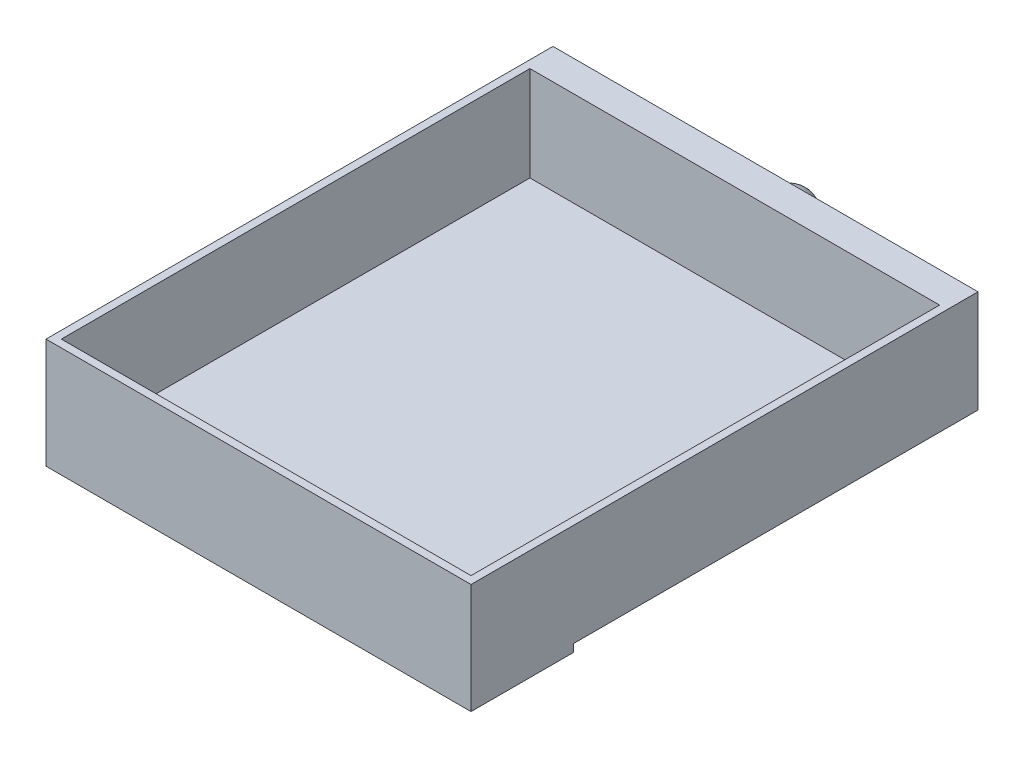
ISO-10303-21;
HEADER;
FILE_DESCRIPTION(('STEP AP214'),'2;1');
FILE_NAME('part.step','',(''),(''),'','','');
FILE_SCHEMA(('AUTOMOTIVE_DESIGN { 1 0 10303 214 1 1 1 1 }'));
ENDSEC;
DATA;
#1=APPLICATION_CONTEXT('core data for automotive mechanical design processes');
#2=APPLICATION_PROTOCOL_DEFINITION('international standard','automotive_design',2000,#1);
#3=PRODUCT_CONTEXT('',#1,'mechanical');
#4=PRODUCT('Part','Part','',(#3));
#5=PRODUCT_RELATED_PRODUCT_CATEGORY('part','',(#4));
#6=PRODUCT_DEFINITION_FORMATION('','',#4);
#7=PRODUCT_DEFINITION_CONTEXT('part definition',#1,'design');
#8=PRODUCT_DEFINITION('design','',#6,#7);
#9=PRODUCT_DEFINITION_SHAPE('','',#8);
#10=(LENGTH_UNIT() NAMED_UNIT(*) SI_UNIT(.MILLI.,.METRE.));
#11=(NAMED_UNIT(*) PLANE_ANGLE_UNIT() SI_UNIT($,.RADIAN.));
#12=(NAMED_UNIT(*) SI_UNIT($,.STERADIAN.) SOLID_ANGLE_UNIT());
#13=UNCERTAINTY_MEASURE_WITH_UNIT(LENGTH_MEASURE(1.E-05),#10,'distance_accuracy_value','');
#14=(GEOMETRIC_REPRESENTATION_CONTEXT(3) GLOBAL_UNCERTAINTY_ASSIGNED_CONTEXT((#13)) GLOBAL_UNIT_ASSIGNED_CONTEXT((#10,
#11,#12)) REPRESENTATION_CONTEXT('',''));
#15=CARTESIAN_POINT('',(0.,0.,0.));
#16=DIRECTION('',(0.,0.,1.));
#17=DIRECTION('',(1.,0.,0.));
#18=AXIS2_PLACEMENT_3D('',#15,#16,#17);
#19=CARTESIAN_POINT('',(0.,12.,0.));
#20=DIRECTION('',(0.,1.,0.));
#21=DIRECTION('',(0.,0.,1.));
#22=AXIS2_PLACEMENT_3D('',#19,#20,#21);
#23=PLANE('',#22);
#24=DIRECTION('',(1.,0.,0.));
#25=VECTOR('',#24,1.);
#26=CARTESIAN_POINT('',(61.,12.,53.));
#27=LINE('',#26,#25);
#28=CARTESIAN_POINT('',(61.,12.,53.));
#29=VERTEX_POINT('',#28);
#30=CARTESIAN_POINT('',(227.,12.,53.));
#31=VERTEX_POINT('',#30);
#32=EDGE_CURVE('E51',#29,#31,#27,.T.);
#33=ORIENTED_EDGE('',*,*,#32,.F.);
#34=DIRECTION('',(0.,0.,1.));
#35=VECTOR('',#34,1.);
#36=CARTESIAN_POINT('',(61.,12.,-93.));
#37=LINE('',#36,#35);
#38=CARTESIAN_POINT('',(61.,12.,-105.));
#39=VERTEX_POINT('',#38);
#40=EDGE_CURVE('E138',#39,#29,#37,.T.);
#41=ORIENTED_EDGE('',*,*,#40,.F.);
#42=DIRECTION('',(-1.,0.,0.));
#43=VECTOR('',#42,1.);
#44=CARTESIAN_POINT('',(227.,12.,-105.));
#45=LINE('',#44,#43);
#46=CARTESIAN_POINT('',(227.,12.,-105.));
#47=VERTEX_POINT('',#46);
#48=EDGE_CURVE('E148',#47,#39,#45,.T.);
#49=ORIENTED_EDGE('',*,*,#48,.F.);
#50=DIRECTION('',(0.,0.,-1.));
#51=VECTOR('',#50,1.);
#52=CARTESIAN_POINT('',(227.,12.,-93.));
#53=LINE('',#52,#51);
#54=EDGE_CURVE('E189',#31,#47,#53,.T.);
#55=ORIENTED_EDGE('',*,*,#54,.F.);
#56=EDGE_LOOP('',(#33,#41,#49,#55));
#57=FACE_BOUND('',#56,.T.);
#58=ADVANCED_FACE('F35',(#57),#23,.F.);
#59=CARTESIAN_POINT('',(61.,52.,-93.));
#60=DIRECTION('',(1.,0.,0.));
#61=DIRECTION('',(0.,0.,-1.));
#62=AXIS2_PLACEMENT_3D('',#59,#60,#61);
#63=PLANE('',#62);
#64=ORIENTED_EDGE('',*,*,#40,.T.);
#65=DIRECTION('',(0.,1.,0.));
#66=VECTOR('',#65,1.);
#67=CARTESIAN_POINT('',(61.,9.,53.));
#68=LINE('',#67,#66);
#69=CARTESIAN_POINT('',(61.,9.,53.));
#70=VERTEX_POINT('',#69);
#71=EDGE_CURVE('E119',#70,#29,#68,.T.);
#72=ORIENTED_EDGE('',*,*,#71,.F.);
#73=DIRECTION('',(0.,0.,-1.));
#74=VECTOR('',#73,1.);
#75=CARTESIAN_POINT('',(61.,9.,93.));
#76=LINE('',#75,#74);
#77=CARTESIAN_POINT('',(61.,9.,93.));
#78=VERTEX_POINT('',#77);
#79=EDGE_CURVE('E126',#78,#70,#76,.T.);
#80=ORIENTED_EDGE('',*,*,#79,.F.);
#81=DIRECTION('',(0.,-1.,0.));
#82=VECTOR('',#81,1.);
#83=CARTESIAN_POINT('',(61.,52.,93.));
#84=LINE('',#83,#82);
#85=CARTESIAN_POINT('',(61.,52.,93.));
#86=VERTEX_POINT('',#85);
#87=EDGE_CURVE('E44',#86,#78,#84,.T.);
#88=ORIENTED_EDGE('',*,*,#87,.F.);
#89=DIRECTION('',(0.,0.,1.));
#90=VECTOR('',#89,1.);
#91=CARTESIAN_POINT('',(61.,52.,-93.));
#92=LINE('',#91,#90);
#93=CARTESIAN_POINT('',(61.,52.,-105.));
#94=VERTEX_POINT('',#93);
#95=EDGE_CURVE('E185',#94,#86,#92,.T.);
#96=ORIENTED_EDGE('',*,*,#95,.F.);
#97=DIRECTION('',(0.,1.,0.));
#98=VECTOR('',#97,1.);
#99=CARTESIAN_POINT('',(61.,12.,-105.));
#100=LINE('',#99,#98);
#101=EDGE_CURVE('E151',#39,#94,#100,.T.);
#102=ORIENTED_EDGE('',*,*,#101,.F.);
#103=EDGE_LOOP('',(#64,#72,#80,#88,#96,#102));
#104=FACE_BOUND('',#103,.T.);
#105=ADVANCED_FACE('F136',(#104),#63,.F.);
#106=CARTESIAN_POINT('',(61.,52.,93.));
#107=DIRECTION('',(0.,0.,-1.));
#108=DIRECTION('',(-1.,0.,0.));
#109=AXIS2_PLACEMENT_3D('',#106,#107,#108);
#110=PLANE('',#109);
#111=ORIENTED_EDGE('',*,*,#87,.T.);
#112=DIRECTION('',(-1.,0.,0.));
#113=VECTOR('',#112,1.);
#114=CARTESIAN_POINT('',(61.,9.,93.));
#115=LINE('',#114,#113);
#116=CARTESIAN_POINT('',(227.,9.,93.));
#117=VERTEX_POINT('',#116);
#118=EDGE_CURVE('E132',#117,#78,#115,.T.);
#119=ORIENTED_EDGE('',*,*,#118,.F.);
#120=DIRECTION('',(0.,-1.,0.));
#121=VECTOR('',#120,1.);
#122=CARTESIAN_POINT('',(227.,52.,93.));
#123=LINE('',#122,#121);
#124=CARTESIAN_POINT('',(227.,52.,93.));
#125=VERTEX_POINT('',#124);
#126=EDGE_CURVE('E193',#125,#117,#123,.T.);
#127=ORIENTED_EDGE('',*,*,#126,.F.);
#128=DIRECTION('',(1.,0.,0.));
#129=VECTOR('',#128,1.);
#130=CARTESIAN_POINT('',(61.,52.,93.));
#131=LINE('',#130,#129);
#132=EDGE_CURVE('E188',#86,#125,#131,.T.);
#133=ORIENTED_EDGE('',*,*,#132,.F.);
#134=EDGE_LOOP('',(#111,#119,#127,#133));
#135=FACE_BOUND('',#134,.T.);
#136=ADVANCED_FACE('F198',(#135),#110,.F.);
#137=CARTESIAN_POINT('',(227.,52.,-93.));
#138=DIRECTION('',(-1.,0.,0.));
#139=DIRECTION('',(0.,0.,1.));
#140=AXIS2_PLACEMENT_3D('',#137,#138,#139);
#141=PLANE('',#140);
#142=ORIENTED_EDGE('',*,*,#126,.T.);
#143=DIRECTION('',(0.,0.,1.));
#144=VECTOR('',#143,1.);
#145=CARTESIAN_POINT('',(227.,9.,93.));
#146=LINE('',#145,#144);
#147=CARTESIAN_POINT('',(227.,9.,53.));
#148=VERTEX_POINT('',#147);
#149=EDGE_CURVE('E125',#148,#117,#146,.T.);
#150=ORIENTED_EDGE('',*,*,#149,.F.);
#151=DIRECTION('',(0.,1.,0.));
#152=VECTOR('',#151,1.);
#153=CARTESIAN_POINT('',(227.,9.,53.));
#154=LINE('',#153,#152);
#155=EDGE_CURVE('E121',#148,#31,#154,.T.);
#156=ORIENTED_EDGE('',*,*,#155,.T.);
#157=ORIENTED_EDGE('',*,*,#54,.T.);
#158=DIRECTION('',(0.,-1.,0.));
#159=VECTOR('',#158,1.);
#160=CARTESIAN_POINT('',(227.,12.,-105.));
#161=LINE('',#160,#159);
#162=CARTESIAN_POINT('',(227.,52.,-105.));
#163=VERTEX_POINT('',#162);
#164=EDGE_CURVE('E145',#163,#47,#161,.T.);
#165=ORIENTED_EDGE('',*,*,#164,.F.);
#166=DIRECTION('',(0.,0.,-1.));
#167=VECTOR('',#166,1.);
#168=CARTESIAN_POINT('',(227.,52.,-93.));
#169=LINE('',#168,#167);
#170=EDGE_CURVE('E191',#125,#163,#169,.T.);
#171=ORIENTED_EDGE('',*,*,#170,.F.);
#172=EDGE_LOOP('',(#142,#150,#156,#157,#165,#171));
#173=FACE_BOUND('',#172,.T.);
#174=ADVANCED_FACE('F210',(#173),#141,.F.);
#175=CARTESIAN_POINT('',(0.,52.,0.));
#176=DIRECTION('',(0.,1.,0.));
#177=DIRECTION('',(0.,0.,1.));
#178=AXIS2_PLACEMENT_3D('',#175,#176,#177);
#179=PLANE('',#178);
#180=DIRECTION('',(1.,0.,0.));
#181=VECTOR('',#180,1.);
#182=CARTESIAN_POINT('',(227.,52.,-105.));
#183=LINE('',#182,#181);
#184=EDGE_CURVE('E154',#94,#163,#183,.T.);
#185=ORIENTED_EDGE('',*,*,#184,.F.);
#186=ORIENTED_EDGE('',*,*,#95,.T.);
#187=ORIENTED_EDGE('',*,*,#132,.T.);
#188=ORIENTED_EDGE('',*,*,#170,.T.);
#189=EDGE_LOOP('',(#185,#186,#187,#188));
#190=FACE_BOUND('',#189,.T.);
#191=DIRECTION('',(0.,0.,1.));
#192=VECTOR('',#191,1.);
#193=CARTESIAN_POINT('',(64.,52.,-93.));
#194=LINE('',#193,#192);
#195=CARTESIAN_POINT('',(64.0000000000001,52.,-93.));
#196=VERTEX_POINT('',#195);
#197=CARTESIAN_POINT('',(64.,52.,90.));
#198=VERTEX_POINT('',#197);
#199=EDGE_CURVE('E173',#196,#198,#194,.T.);
#200=ORIENTED_EDGE('',*,*,#199,.F.);
#201=DIRECTION('',(1.,0.,0.));
#202=VECTOR('',#201,1.);
#203=CARTESIAN_POINT('',(227.,52.,-93.));
#204=LINE('',#203,#202);
#205=CARTESIAN_POINT('',(224.,52.,-93.));
#206=VERTEX_POINT('',#205);
#207=EDGE_CURVE('E141',#196,#206,#204,.T.);
#208=ORIENTED_EDGE('',*,*,#207,.T.);
#209=DIRECTION('',(0.,0.,-1.));
#210=VECTOR('',#209,1.);
#211=CARTESIAN_POINT('',(224.,52.,-93.));
#212=LINE('',#211,#210);
#213=CARTESIAN_POINT('',(224.,52.,90.));
#214=VERTEX_POINT('',#213);
#215=EDGE_CURVE('E177',#214,#206,#212,.T.);
#216=ORIENTED_EDGE('',*,*,#215,.F.);
#217=DIRECTION('',(1.,0.,0.));
#218=VECTOR('',#217,1.);
#219=CARTESIAN_POINT('',(61.,52.,90.));
#220=LINE('',#219,#218);
#221=EDGE_CURVE('E175',#198,#214,#220,.T.);
#222=ORIENTED_EDGE('',*,*,#221,.F.);
#223=EDGE_LOOP('',(#200,#208,#216,#222));
#224=FACE_BOUND('',#223,.T.);
#225=ADVANCED_FACE('F206',(#190,#224),#179,.T.);
#226=CARTESIAN_POINT('',(64.,52.,-93.));
#227=DIRECTION('',(1.,0.,0.));
#228=DIRECTION('',(0.,0.,-1.));
#229=AXIS2_PLACEMENT_3D('',#226,#227,#228);
#230=PLANE('',#229);
#231=DIRECTION('',(0.,0.,1.));
#232=VECTOR('',#231,1.);
#233=CARTESIAN_POINT('',(64.,15.,-93.));
#234=LINE('',#233,#232);
#235=CARTESIAN_POINT('',(64.,15.,-93.));
#236=VERTEX_POINT('',#235);
#237=CARTESIAN_POINT('',(64.,15.,90.));
#238=VERTEX_POINT('',#237);
#239=EDGE_CURVE('E157',#236,#238,#234,.T.);
#240=ORIENTED_EDGE('',*,*,#239,.F.);
#241=DIRECTION('',(0.,-1.,0.));
#242=VECTOR('',#241,1.);
#243=CARTESIAN_POINT('',(64.,52.,-93.));
#244=LINE('',#243,#242);
#245=EDGE_CURVE('E179',#196,#236,#244,.T.);
#246=ORIENTED_EDGE('',*,*,#245,.F.);
#247=ORIENTED_EDGE('',*,*,#199,.T.);
#248=DIRECTION('',(0.,-1.,0.));
#249=VECTOR('',#248,1.);
#250=CARTESIAN_POINT('',(64.,52.,90.));
#251=LINE('',#250,#249);
#252=EDGE_CURVE('E163',#198,#238,#251,.T.);
#253=ORIENTED_EDGE('',*,*,#252,.T.);
#254=EDGE_LOOP('',(#240,#246,#247,#253));
#255=FACE_BOUND('',#254,.T.);
#256=ADVANCED_FACE('F240',(#255),#230,.T.);
#257=CARTESIAN_POINT('',(61.,52.,90.));
#258=DIRECTION('',(0.,0.,-1.));
#259=DIRECTION('',(-1.,0.,0.));
#260=AXIS2_PLACEMENT_3D('',#257,#258,#259);
#261=PLANE('',#260);
#262=DIRECTION('',(1.,0.,0.));
#263=VECTOR('',#262,1.);
#264=CARTESIAN_POINT('',(61.,15.,90.));
#265=LINE('',#264,#263);
#266=CARTESIAN_POINT('',(224.,15.,90.));
#267=VERTEX_POINT('',#266);
#268=EDGE_CURVE('E162',#238,#267,#265,.T.);
#269=ORIENTED_EDGE('',*,*,#268,.F.);
#270=ORIENTED_EDGE('',*,*,#252,.F.);
#271=ORIENTED_EDGE('',*,*,#221,.T.);
#272=DIRECTION('',(0.,-1.,0.));
#273=VECTOR('',#272,1.);
#274=CARTESIAN_POINT('',(224.,52.,90.));
#275=LINE('',#274,#273);
#276=EDGE_CURVE('E59',#214,#267,#275,.T.);
#277=ORIENTED_EDGE('',*,*,#276,.T.);
#278=EDGE_LOOP('',(#269,#270,#271,#277));
#279=FACE_BOUND('',#278,.T.);
#280=ADVANCED_FACE('F246',(#279),#261,.T.);
#281=CARTESIAN_POINT('',(224.,52.,-93.));
#282=DIRECTION('',(-1.,0.,0.));
#283=DIRECTION('',(0.,0.,1.));
#284=AXIS2_PLACEMENT_3D('',#281,#282,#283);
#285=PLANE('',#284);
#286=DIRECTION('',(0.,0.,-1.));
#287=VECTOR('',#286,1.);
#288=CARTESIAN_POINT('',(224.,15.,-93.));
#289=LINE('',#288,#287);
#290=CARTESIAN_POINT('',(224.,15.,-93.));
#291=VERTEX_POINT('',#290);
#292=EDGE_CURVE('E167',#267,#291,#289,.T.);
#293=ORIENTED_EDGE('',*,*,#292,.F.);
#294=ORIENTED_EDGE('',*,*,#276,.F.);
#295=ORIENTED_EDGE('',*,*,#215,.T.);
#296=DIRECTION('',(0.,-1.,0.));
#297=VECTOR('',#296,1.);
#298=CARTESIAN_POINT('',(224.,52.,-93.));
#299=LINE('',#298,#297);
#300=EDGE_CURVE('E169',#206,#291,#299,.T.);
#301=ORIENTED_EDGE('',*,*,#300,.T.);
#302=EDGE_LOOP('',(#293,#294,#295,#301));
#303=FACE_BOUND('',#302,.T.);
#304=ADVANCED_FACE('F255',(#303),#285,.T.);
#305=CARTESIAN_POINT('',(0.,15.,0.));
#306=DIRECTION('',(0.,1.,0.));
#307=DIRECTION('',(0.,0.,1.));
#308=AXIS2_PLACEMENT_3D('',#305,#306,#307);
#309=PLANE('',#308);
#310=ORIENTED_EDGE('',*,*,#239,.T.);
#311=ORIENTED_EDGE('',*,*,#268,.T.);
#312=ORIENTED_EDGE('',*,*,#292,.T.);
#313=DIRECTION('',(-1.,0.,0.));
#314=VECTOR('',#313,1.);
#315=CARTESIAN_POINT('',(61.,15.,-93.));
#316=LINE('',#315,#314);
#317=EDGE_CURVE('E172',#291,#236,#316,.T.);
#318=ORIENTED_EDGE('',*,*,#317,.T.);
#319=EDGE_LOOP('',(#310,#311,#312,#318));
#320=FACE_BOUND('',#319,.T.);
#321=ADVANCED_FACE('F264',(#320),#309,.T.);
#322=CARTESIAN_POINT('',(0.,0.,-105.));
#323=DIRECTION('',(0.,0.,1.));
#324=DIRECTION('',(1.,0.,0.));
#325=AXIS2_PLACEMENT_3D('',#322,#323,#324);
#326=PLANE('',#325);
#327=CARTESIAN_POINT('',(144.,32.,-105.));
#328=DIRECTION('',(0.,0.,1.));
#329=DIRECTION('',(1.,0.,0.));
#330=AXIS2_PLACEMENT_3D('',#327,#328,#329);
#331=CIRCLE('',#330,6.00000000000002);
#332=CARTESIAN_POINT('',(150.,32.,-105.));
#333=VERTEX_POINT('',#332);
#334=EDGE_CURVE('E11',#333,#333,#331,.F.);
#335=ORIENTED_EDGE('',*,*,#334,.F.);
#336=EDGE_LOOP('',(#335));
#337=FACE_BOUND('',#336,.T.);
#338=ORIENTED_EDGE('',*,*,#164,.T.);
#339=ORIENTED_EDGE('',*,*,#48,.T.);
#340=ORIENTED_EDGE('',*,*,#101,.T.);
#341=ORIENTED_EDGE('',*,*,#184,.T.);
#342=EDGE_LOOP('',(#338,#339,#340,#341));
#343=FACE_BOUND('',#342,.T.);
#344=ADVANCED_FACE('F203',(#337,#343),#326,.F.);
#345=CARTESIAN_POINT('',(0.,0.,-93.));
#346=DIRECTION('',(0.,0.,1.));
#347=DIRECTION('',(1.,0.,0.));
#348=AXIS2_PLACEMENT_3D('',#345,#346,#347);
#349=PLANE('',#348);
#350=ORIENTED_EDGE('',*,*,#207,.F.);
#351=ORIENTED_EDGE('',*,*,#245,.T.);
#352=ORIENTED_EDGE('',*,*,#317,.F.);
#353=ORIENTED_EDGE('',*,*,#300,.F.);
#354=EDGE_LOOP('',(#350,#351,#352,#353));
#355=FACE_BOUND('',#354,.T.);
#356=ADVANCED_FACE('F279',(#355),#349,.T.);
#357=CARTESIAN_POINT('',(144.,32.,-108.));
#358=DIRECTION('',(0.,0.,1.));
#359=DIRECTION('',(1.,0.,0.));
#360=AXIS2_PLACEMENT_3D('',#357,#358,#359);
#361=CYLINDRICAL_SURFACE('',#360,6.00000000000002);
#362=CARTESIAN_POINT('',(144.,32.,-108.));
#363=DIRECTION('',(0.,0.,-1.));
#364=DIRECTION('',(-1.,0.,0.));
#365=AXIS2_PLACEMENT_3D('',#362,#363,#364);
#366=CIRCLE('',#365,6.00000000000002);
#367=CARTESIAN_POINT('',(138.,32.,-108.));
#368=VERTEX_POINT('',#367);
#369=EDGE_CURVE('E39',#368,#368,#366,.T.);
#370=ORIENTED_EDGE('',*,*,#369,.F.);
#371=EDGE_LOOP('',(#370));
#372=FACE_BOUND('',#371,.T.);
#373=ORIENTED_EDGE('',*,*,#334,.T.);
#374=EDGE_LOOP('',(#373));
#375=FACE_BOUND('',#374,.T.);
#376=ADVANCED_FACE('F288',(#372,#375),#361,.T.);
#377=CARTESIAN_POINT('',(144.,32.,-114.3));
#378=DIRECTION('',(0.,0.,1.));
#379=DIRECTION('',(1.,0.,0.));
#380=AXIS2_PLACEMENT_3D('',#377,#378,#379);
#381=SPHERICAL_SURFACE('',#380,8.70000000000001);
#382=ORIENTED_EDGE('',*,*,#369,.T.);
#383=EDGE_LOOP('',(#382));
#384=FACE_BOUND('',#383,.T.);
#385=ADVANCED_FACE('F37',(#384),#381,.T.);
#386=CARTESIAN_POINT('',(61.,9.,53.));
#387=DIRECTION('',(0.,0.,1.));
#388=DIRECTION('',(1.,0.,0.));
#389=AXIS2_PLACEMENT_3D('',#386,#387,#388);
#390=PLANE('',#389);
#391=ORIENTED_EDGE('',*,*,#32,.T.);
#392=ORIENTED_EDGE('',*,*,#155,.F.);
#393=DIRECTION('',(1.,0.,0.));
#394=VECTOR('',#393,1.);
#395=CARTESIAN_POINT('',(61.,9.,53.));
#396=LINE('',#395,#394);
#397=EDGE_CURVE('E115',#70,#148,#396,.T.);
#398=ORIENTED_EDGE('',*,*,#397,.F.);
#399=ORIENTED_EDGE('',*,*,#71,.T.);
#400=EDGE_LOOP('',(#391,#392,#398,#399));
#401=FACE_BOUND('',#400,.T.);
#402=ADVANCED_FACE('F117',(#401),#390,.F.);
#403=CARTESIAN_POINT('',(0.,9.,0.));
#404=DIRECTION('',(0.,-1.,0.));
#405=DIRECTION('',(0.,0.,-1.));
#406=AXIS2_PLACEMENT_3D('',#403,#404,#405);
#407=PLANE('',#406);
#408=ORIENTED_EDGE('',*,*,#79,.T.);
#409=ORIENTED_EDGE('',*,*,#397,.T.);
#410=ORIENTED_EDGE('',*,*,#149,.T.);
#411=ORIENTED_EDGE('',*,*,#118,.T.);
#412=EDGE_LOOP('',(#408,#409,#410,#411));
#413=FACE_BOUND('',#412,.T.);
#414=ADVANCED_FACE('F130',(#413),#407,.T.);
#415=CLOSED_SHELL('',(#58,#105,#136,#174,#225,#256,#280,#304,#321,#344,#356,#376,#385,#402,#414));
#416=MANIFOLD_SOLID_BREP('B2',#415);
#417=ADVANCED_BREP_SHAPE_REPRESENTATION('',(#18,#416),#14);
#418=SHAPE_DEFINITION_REPRESENTATION(#9,#417);
ENDSEC;
END-ISO-10303-21;
